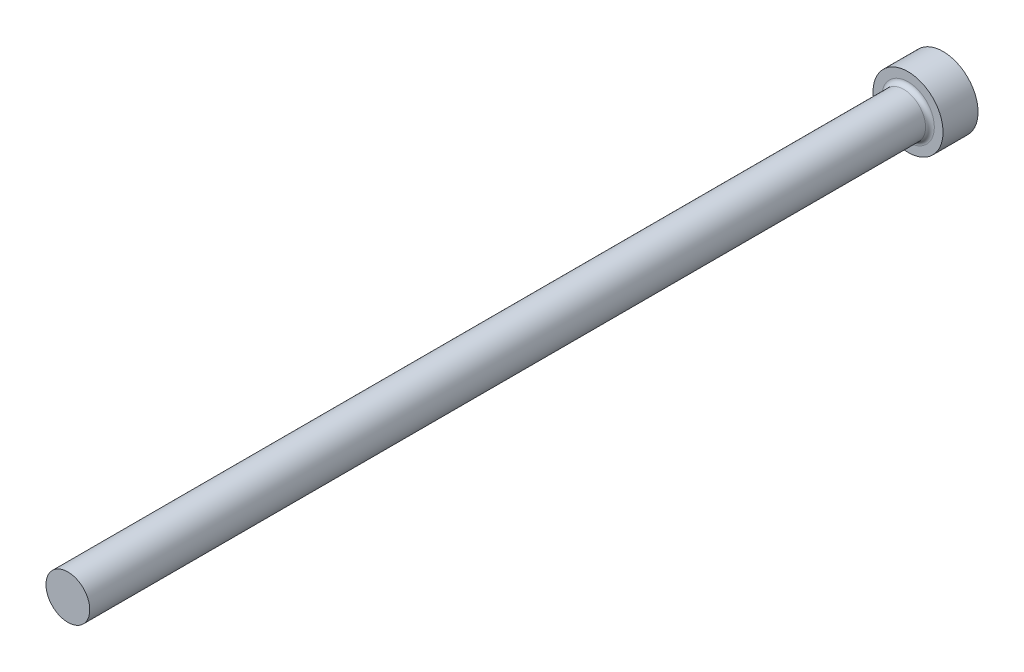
ISO-10303-21;
HEADER;
FILE_DESCRIPTION(('STEP AP214'),'2;1');
FILE_NAME('part.step','',(''),(''),'','','');
FILE_SCHEMA(('AUTOMOTIVE_DESIGN { 1 0 10303 214 1 1 1 1 }'));
ENDSEC;
DATA;
#1=APPLICATION_CONTEXT('core data for automotive mechanical design processes');
#2=APPLICATION_PROTOCOL_DEFINITION('international standard','automotive_design',2000,#1);
#3=PRODUCT_CONTEXT('',#1,'mechanical');
#4=PRODUCT('Part','Part','',(#3));
#5=PRODUCT_RELATED_PRODUCT_CATEGORY('part','',(#4));
#6=PRODUCT_DEFINITION_FORMATION('','',#4);
#7=PRODUCT_DEFINITION_CONTEXT('part definition',#1,'design');
#8=PRODUCT_DEFINITION('design','',#6,#7);
#9=PRODUCT_DEFINITION_SHAPE('','',#8);
#10=(LENGTH_UNIT() NAMED_UNIT(*) SI_UNIT(.MILLI.,.METRE.));
#11=(NAMED_UNIT(*) PLANE_ANGLE_UNIT() SI_UNIT($,.RADIAN.));
#12=(NAMED_UNIT(*) SI_UNIT($,.STERADIAN.) SOLID_ANGLE_UNIT());
#13=UNCERTAINTY_MEASURE_WITH_UNIT(LENGTH_MEASURE(1.E-05),#10,'distance_accuracy_value','');
#14=(GEOMETRIC_REPRESENTATION_CONTEXT(3) GLOBAL_UNCERTAINTY_ASSIGNED_CONTEXT((#13)) GLOBAL_UNIT_ASSIGNED_CONTEXT((#10,
#11,#12)) REPRESENTATION_CONTEXT('',''));
#15=CARTESIAN_POINT('',(0.,0.,0.));
#16=DIRECTION('',(0.,0.,1.));
#17=DIRECTION('',(1.,0.,0.));
#18=AXIS2_PLACEMENT_3D('',#15,#16,#17);
#19=CARTESIAN_POINT('',(4.,0.,4.));
#20=DIRECTION('',(0.,0.,-1.));
#21=DIRECTION('',(-1.,0.,0.));
#22=AXIS2_PLACEMENT_3D('',#19,#20,#21);
#23=PLANE('',#22);
#24=CARTESIAN_POINT('',(0.,0.,4.));
#25=DIRECTION('',(0.,0.,-1.));
#26=DIRECTION('',(-1.,0.,0.));
#27=AXIS2_PLACEMENT_3D('',#24,#25,#26);
#28=CIRCLE('',#27,3.00000000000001);
#29=CARTESIAN_POINT('',(-3.00000000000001,0.,4.));
#30=VERTEX_POINT('',#29);
#31=EDGE_CURVE('E40',#30,#30,#28,.T.);
#32=ORIENTED_EDGE('',*,*,#31,.T.);
#33=EDGE_LOOP('',(#32));
#34=FACE_BOUND('',#33,.T.);
#35=CARTESIAN_POINT('',(0.,0.,4.));
#36=DIRECTION('',(0.,0.,-1.));
#37=DIRECTION('',(-1.,0.,0.));
#38=AXIS2_PLACEMENT_3D('',#35,#36,#37);
#39=CIRCLE('',#38,4.);
#40=CARTESIAN_POINT('',(-4.,0.,4.));
#41=VERTEX_POINT('',#40);
#42=EDGE_CURVE('E44',#41,#41,#39,.T.);
#43=ORIENTED_EDGE('',*,*,#42,.F.);
#44=EDGE_LOOP('',(#43));
#45=FACE_BOUND('',#44,.T.);
#46=ADVANCED_FACE('F33',(#34,#45),#23,.F.);
#47=CARTESIAN_POINT('',(0.,0.,-9.03322817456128));
#48=DIRECTION('',(0.,0.,-1.));
#49=DIRECTION('',(-1.,0.,0.));
#50=AXIS2_PLACEMENT_3D('',#47,#48,#49);
#51=CYLINDRICAL_SURFACE('',#50,4.);
#52=CARTESIAN_POINT('',(0.,0.,0.));
#53=DIRECTION('',(0.,0.,-1.));
#54=DIRECTION('',(-1.,0.,0.));
#55=AXIS2_PLACEMENT_3D('',#52,#53,#54);
#56=CIRCLE('',#55,4.);
#57=CARTESIAN_POINT('',(-4.,0.,0.));
#58=VERTEX_POINT('',#57);
#59=EDGE_CURVE('E48',#58,#58,#56,.T.);
#60=ORIENTED_EDGE('',*,*,#59,.F.);
#61=EDGE_LOOP('',(#60));
#62=FACE_BOUND('',#61,.T.);
#63=ORIENTED_EDGE('',*,*,#42,.T.);
#64=EDGE_LOOP('',(#63));
#65=FACE_BOUND('',#64,.T.);
#66=ADVANCED_FACE('F68',(#62,#65),#51,.T.);
#67=CARTESIAN_POINT('',(0.,0.,0.));
#68=DIRECTION('',(0.,0.,1.));
#69=DIRECTION('',(1.,0.,0.));
#70=AXIS2_PLACEMENT_3D('',#67,#68,#69);
#71=PLANE('',#70);
#72=ORIENTED_EDGE('',*,*,#59,.T.);
#73=EDGE_LOOP('',(#72));
#74=FACE_BOUND('',#73,.T.);
#75=ADVANCED_FACE('F61',(#74),#71,.F.);
#76=CARTESIAN_POINT('',(0.,0.,100.));
#77=DIRECTION('',(0.,0.,-1.));
#78=DIRECTION('',(-1.,0.,0.));
#79=AXIS2_PLACEMENT_3D('',#76,#77,#78);
#80=PLANE('',#79);
#81=CARTESIAN_POINT('',(0.,0.,100.));
#82=DIRECTION('',(0.,0.,-1.));
#83=DIRECTION('',(-1.,0.,0.));
#84=AXIS2_PLACEMENT_3D('',#81,#82,#83);
#85=CIRCLE('',#84,2.50000000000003);
#86=CARTESIAN_POINT('',(-2.50000000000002,0.,100.));
#87=VERTEX_POINT('',#86);
#88=EDGE_CURVE('E53',#87,#87,#85,.T.);
#89=ORIENTED_EDGE('',*,*,#88,.F.);
#90=EDGE_LOOP('',(#89));
#91=FACE_BOUND('',#90,.T.);
#92=ADVANCED_FACE('F59',(#91),#80,.F.);
#93=CARTESIAN_POINT('',(0.,0.,-9.03322817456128));
#94=DIRECTION('',(0.,0.,-1.));
#95=DIRECTION('',(-1.,0.,0.));
#96=AXIS2_PLACEMENT_3D('',#93,#94,#95);
#97=CYLINDRICAL_SURFACE('',#96,2.50000000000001);
#98=CARTESIAN_POINT('',(0.,0.,4.5));
#99=DIRECTION('',(0.,0.,-1.));
#100=DIRECTION('',(-1.,0.,0.));
#101=AXIS2_PLACEMENT_3D('',#98,#99,#100);
#102=CIRCLE('',#101,2.50000000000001);
#103=CARTESIAN_POINT('',(-2.50000000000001,0.,4.5));
#104=VERTEX_POINT('',#103);
#105=EDGE_CURVE('E10',#104,#104,#102,.F.);
#106=ORIENTED_EDGE('',*,*,#105,.T.);
#107=EDGE_LOOP('',(#106));
#108=FACE_BOUND('',#107,.T.);
#109=ORIENTED_EDGE('',*,*,#88,.T.);
#110=EDGE_LOOP('',(#109));
#111=FACE_BOUND('',#110,.T.);
#112=ADVANCED_FACE('F57',(#108,#111),#97,.T.);
#113=CARTESIAN_POINT('',(0.,0.,4.5));
#114=DIRECTION('',(0.,0.,-1.));
#115=DIRECTION('',(-1.,0.,0.));
#116=AXIS2_PLACEMENT_3D('',#113,#114,#115);
#117=TOROIDAL_SURFACE('',#116,3.00000000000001,0.5);
#118=ORIENTED_EDGE('',*,*,#105,.F.);
#119=EDGE_LOOP('',(#118));
#120=FACE_BOUND('',#119,.T.);
#121=ORIENTED_EDGE('',*,*,#31,.F.);
#122=EDGE_LOOP('',(#121));
#123=FACE_BOUND('',#122,.T.);
#124=ADVANCED_FACE('F35',(#120,#123),#117,.F.);
#125=CLOSED_SHELL('',(#46,#66,#75,#92,#112,#124));
#126=MANIFOLD_SOLID_BREP('B2',#125);
#127=ADVANCED_BREP_SHAPE_REPRESENTATION('',(#18,#126),#14);
#128=SHAPE_DEFINITION_REPRESENTATION(#9,#127);
ENDSEC;
END-ISO-10303-21;
